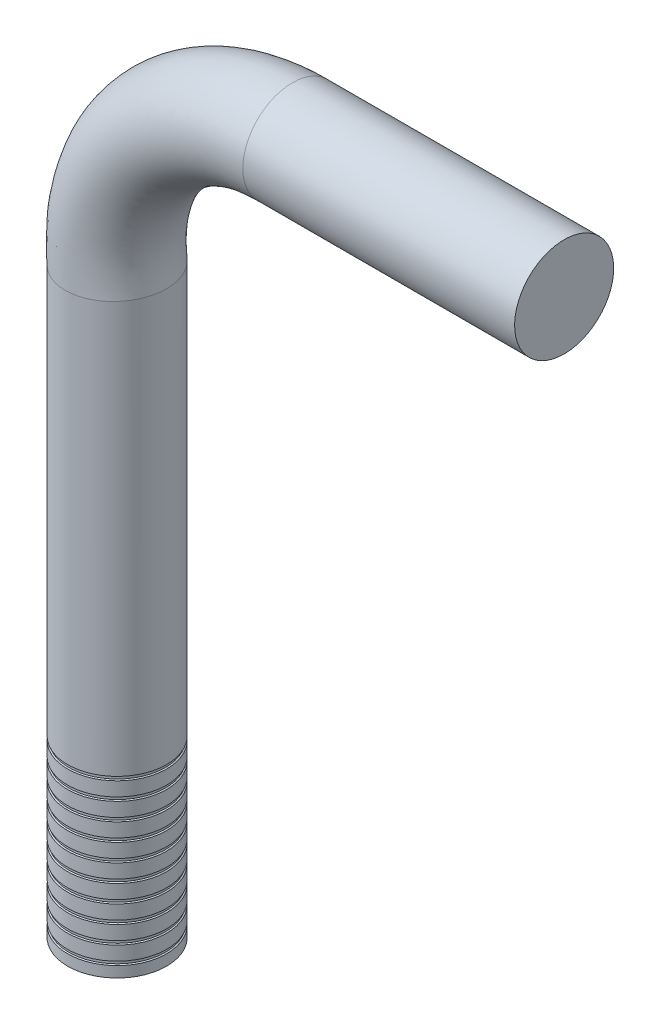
ISO-10303-21;
HEADER;
FILE_DESCRIPTION(('STEP AP214'),'2;1');
FILE_NAME('part.step','',(''),(''),'','','');
FILE_SCHEMA(('AUTOMOTIVE_DESIGN { 1 0 10303 214 1 1 1 1 }'));
ENDSEC;
DATA;
#1=APPLICATION_CONTEXT('core data for automotive mechanical design processes');
#2=APPLICATION_PROTOCOL_DEFINITION('international standard','automotive_design',2000,#1);
#3=PRODUCT_CONTEXT('',#1,'mechanical');
#4=PRODUCT('Part','Part','',(#3));
#5=PRODUCT_RELATED_PRODUCT_CATEGORY('part','',(#4));
#6=PRODUCT_DEFINITION_FORMATION('','',#4);
#7=PRODUCT_DEFINITION_CONTEXT('part definition',#1,'design');
#8=PRODUCT_DEFINITION('design','',#6,#7);
#9=PRODUCT_DEFINITION_SHAPE('','',#8);
#10=(LENGTH_UNIT() NAMED_UNIT(*) SI_UNIT(.MILLI.,.METRE.));
#11=(NAMED_UNIT(*) PLANE_ANGLE_UNIT() SI_UNIT($,.RADIAN.));
#12=(NAMED_UNIT(*) SI_UNIT($,.STERADIAN.) SOLID_ANGLE_UNIT());
#13=UNCERTAINTY_MEASURE_WITH_UNIT(LENGTH_MEASURE(1.E-05),#10,'distance_accuracy_value','');
#14=(GEOMETRIC_REPRESENTATION_CONTEXT(3) GLOBAL_UNCERTAINTY_ASSIGNED_CONTEXT((#13)) GLOBAL_UNIT_ASSIGNED_CONTEXT((#10,
#11,#12)) REPRESENTATION_CONTEXT('',''));
#15=CARTESIAN_POINT('',(0.,0.,0.));
#16=DIRECTION('',(0.,0.,1.));
#17=DIRECTION('',(1.,0.,0.));
#18=AXIS2_PLACEMENT_3D('',#15,#16,#17);
#19=CARTESIAN_POINT('',(0.,285.15432893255,0.));
#20=DIRECTION('',(0.,-1.,0.));
#21=DIRECTION('',(0.,0.,-1.));
#22=AXIS2_PLACEMENT_3D('',#19,#20,#21);
#23=CYLINDRICAL_SURFACE('',#22,19.5);
#24=CARTESIAN_POINT('',(0.,67.25,0.));
#25=DIRECTION('',(0.,-1.,0.));
#26=DIRECTION('',(0.,0.,-1.));
#27=AXIS2_PLACEMENT_3D('',#24,#25,#26);
#28=CIRCLE('',#27,19.5);
#29=CARTESIAN_POINT('',(0.,67.25,-19.5));
#30=VERTEX_POINT('',#29);
#31=EDGE_CURVE('E145',#30,#30,#28,.T.);
#32=ORIENTED_EDGE('',*,*,#31,.T.);
#33=EDGE_LOOP('',(#32));
#34=FACE_BOUND('',#33,.T.);
#35=CARTESIAN_POINT('',(0.,61.75,0.));
#36=DIRECTION('',(0.,-1.,0.));
#37=DIRECTION('',(0.,0.,-1.));
#38=AXIS2_PLACEMENT_3D('',#35,#36,#37);
#39=CIRCLE('',#38,19.5);
#40=CARTESIAN_POINT('',(0.,61.75,-19.5));
#41=VERTEX_POINT('',#40);
#42=EDGE_CURVE('E136',#41,#41,#39,.T.);
#43=ORIENTED_EDGE('',*,*,#42,.F.);
#44=EDGE_LOOP('',(#43));
#45=FACE_BOUND('',#44,.T.);
#46=ADVANCED_FACE('F14',(#34,#45),#23,.T.);
#47=CARTESIAN_POINT('',(0.,60.25,0.));
#48=DIRECTION('',(0.,-1.,0.));
#49=DIRECTION('',(0.,0.,-1.));
#50=AXIS2_PLACEMENT_3D('',#47,#48,#49);
#51=CIRCLE('',#50,19.5);
#52=CARTESIAN_POINT('',(0.,60.25,-19.5));
#53=VERTEX_POINT('',#52);
#54=EDGE_CURVE('E133',#53,#53,#51,.T.);
#55=ORIENTED_EDGE('',*,*,#54,.T.);
#56=EDGE_LOOP('',(#55));
#57=FACE_BOUND('',#56,.T.);
#58=CARTESIAN_POINT('',(0.,54.75,0.));
#59=DIRECTION('',(0.,-1.,0.));
#60=DIRECTION('',(0.,0.,-1.));
#61=AXIS2_PLACEMENT_3D('',#58,#59,#60);
#62=CIRCLE('',#61,19.5);
#63=CARTESIAN_POINT('',(0.,54.75,-19.5));
#64=VERTEX_POINT('',#63);
#65=EDGE_CURVE('E124',#64,#64,#62,.T.);
#66=ORIENTED_EDGE('',*,*,#65,.F.);
#67=EDGE_LOOP('',(#66));
#68=FACE_BOUND('',#67,.T.);
#69=ADVANCED_FACE('F178',(#57,#68),#23,.T.);
#70=CARTESIAN_POINT('',(0.,53.25,0.));
#71=DIRECTION('',(0.,-1.,0.));
#72=DIRECTION('',(0.,0.,-1.));
#73=AXIS2_PLACEMENT_3D('',#70,#71,#72);
#74=CIRCLE('',#73,19.5);
#75=CARTESIAN_POINT('',(0.,53.25,-19.5));
#76=VERTEX_POINT('',#75);
#77=EDGE_CURVE('E121',#76,#76,#74,.T.);
#78=ORIENTED_EDGE('',*,*,#77,.T.);
#79=EDGE_LOOP('',(#78));
#80=FACE_BOUND('',#79,.T.);
#81=CARTESIAN_POINT('',(0.,47.75,0.));
#82=DIRECTION('',(0.,-1.,0.));
#83=DIRECTION('',(0.,0.,-1.));
#84=AXIS2_PLACEMENT_3D('',#81,#82,#83);
#85=CIRCLE('',#84,19.5);
#86=CARTESIAN_POINT('',(0.,47.75,-19.5));
#87=VERTEX_POINT('',#86);
#88=EDGE_CURVE('E112',#87,#87,#85,.T.);
#89=ORIENTED_EDGE('',*,*,#88,.F.);
#90=EDGE_LOOP('',(#89));
#91=FACE_BOUND('',#90,.T.);
#92=ADVANCED_FACE('F548',(#80,#91),#23,.T.);
#93=CARTESIAN_POINT('',(0.,46.25,0.));
#94=DIRECTION('',(0.,-1.,0.));
#95=DIRECTION('',(0.,0.,-1.));
#96=AXIS2_PLACEMENT_3D('',#93,#94,#95);
#97=CIRCLE('',#96,19.5);
#98=CARTESIAN_POINT('',(0.,46.25,-19.5));
#99=VERTEX_POINT('',#98);
#100=EDGE_CURVE('E109',#99,#99,#97,.T.);
#101=ORIENTED_EDGE('',*,*,#100,.T.);
#102=EDGE_LOOP('',(#101));
#103=FACE_BOUND('',#102,.T.);
#104=CARTESIAN_POINT('',(0.,40.75,0.));
#105=DIRECTION('',(0.,-1.,0.));
#106=DIRECTION('',(0.,0.,-1.));
#107=AXIS2_PLACEMENT_3D('',#104,#105,#106);
#108=CIRCLE('',#107,19.5);
#109=CARTESIAN_POINT('',(0.,40.75,-19.5));
#110=VERTEX_POINT('',#109);
#111=EDGE_CURVE('E100',#110,#110,#108,.T.);
#112=ORIENTED_EDGE('',*,*,#111,.F.);
#113=EDGE_LOOP('',(#112));
#114=FACE_BOUND('',#113,.T.);
#115=ADVANCED_FACE('F539',(#103,#114),#23,.T.);
#116=CARTESIAN_POINT('',(0.,39.25,0.));
#117=DIRECTION('',(0.,-1.,0.));
#118=DIRECTION('',(0.,0.,-1.));
#119=AXIS2_PLACEMENT_3D('',#116,#117,#118);
#120=CIRCLE('',#119,19.5);
#121=CARTESIAN_POINT('',(0.,39.25,-19.5));
#122=VERTEX_POINT('',#121);
#123=EDGE_CURVE('E97',#122,#122,#120,.T.);
#124=ORIENTED_EDGE('',*,*,#123,.T.);
#125=EDGE_LOOP('',(#124));
#126=FACE_BOUND('',#125,.T.);
#127=CARTESIAN_POINT('',(0.,33.75,0.));
#128=DIRECTION('',(0.,-1.,0.));
#129=DIRECTION('',(0.,0.,-1.));
#130=AXIS2_PLACEMENT_3D('',#127,#128,#129);
#131=CIRCLE('',#130,19.5);
#132=CARTESIAN_POINT('',(0.,33.75,-19.5));
#133=VERTEX_POINT('',#132);
#134=EDGE_CURVE('E88',#133,#133,#131,.T.);
#135=ORIENTED_EDGE('',*,*,#134,.F.);
#136=EDGE_LOOP('',(#135));
#137=FACE_BOUND('',#136,.T.);
#138=ADVANCED_FACE('F530',(#126,#137),#23,.T.);
#139=CARTESIAN_POINT('',(0.,32.25,0.));
#140=DIRECTION('',(0.,-1.,0.));
#141=DIRECTION('',(0.,0.,-1.));
#142=AXIS2_PLACEMENT_3D('',#139,#140,#141);
#143=CIRCLE('',#142,19.5);
#144=CARTESIAN_POINT('',(0.,32.25,-19.5));
#145=VERTEX_POINT('',#144);
#146=EDGE_CURVE('E85',#145,#145,#143,.T.);
#147=ORIENTED_EDGE('',*,*,#146,.T.);
#148=EDGE_LOOP('',(#147));
#149=FACE_BOUND('',#148,.T.);
#150=CARTESIAN_POINT('',(0.,26.75,0.));
#151=DIRECTION('',(0.,-1.,0.));
#152=DIRECTION('',(0.,0.,-1.));
#153=AXIS2_PLACEMENT_3D('',#150,#151,#152);
#154=CIRCLE('',#153,19.5);
#155=CARTESIAN_POINT('',(0.,26.75,-19.5));
#156=VERTEX_POINT('',#155);
#157=EDGE_CURVE('E76',#156,#156,#154,.T.);
#158=ORIENTED_EDGE('',*,*,#157,.F.);
#159=EDGE_LOOP('',(#158));
#160=FACE_BOUND('',#159,.T.);
#161=ADVANCED_FACE('F521',(#149,#160),#23,.T.);
#162=CARTESIAN_POINT('',(0.,25.25,0.));
#163=DIRECTION('',(0.,-1.,0.));
#164=DIRECTION('',(0.,0.,-1.));
#165=AXIS2_PLACEMENT_3D('',#162,#163,#164);
#166=CIRCLE('',#165,19.5);
#167=CARTESIAN_POINT('',(0.,25.25,-19.5));
#168=VERTEX_POINT('',#167);
#169=EDGE_CURVE('E73',#168,#168,#166,.T.);
#170=ORIENTED_EDGE('',*,*,#169,.T.);
#171=EDGE_LOOP('',(#170));
#172=FACE_BOUND('',#171,.T.);
#173=CARTESIAN_POINT('',(0.,19.75,0.));
#174=DIRECTION('',(0.,-1.,0.));
#175=DIRECTION('',(0.,0.,-1.));
#176=AXIS2_PLACEMENT_3D('',#173,#174,#175);
#177=CIRCLE('',#176,19.5);
#178=CARTESIAN_POINT('',(0.,19.75,-19.5));
#179=VERTEX_POINT('',#178);
#180=EDGE_CURVE('E64',#179,#179,#177,.T.);
#181=ORIENTED_EDGE('',*,*,#180,.F.);
#182=EDGE_LOOP('',(#181));
#183=FACE_BOUND('',#182,.T.);
#184=ADVANCED_FACE('F208',(#172,#183),#23,.T.);
#185=CARTESIAN_POINT('',(0.,18.25,0.));
#186=DIRECTION('',(0.,-1.,0.));
#187=DIRECTION('',(0.,0.,-1.));
#188=AXIS2_PLACEMENT_3D('',#185,#186,#187);
#189=CIRCLE('',#188,19.5);
#190=CARTESIAN_POINT('',(0.,18.25,-19.5));
#191=VERTEX_POINT('',#190);
#192=EDGE_CURVE('E61',#191,#191,#189,.T.);
#193=ORIENTED_EDGE('',*,*,#192,.T.);
#194=EDGE_LOOP('',(#193));
#195=FACE_BOUND('',#194,.T.);
#196=CARTESIAN_POINT('',(0.,12.75,0.));
#197=DIRECTION('',(0.,-1.,0.));
#198=DIRECTION('',(0.,0.,-1.));
#199=AXIS2_PLACEMENT_3D('',#196,#197,#198);
#200=CIRCLE('',#199,19.5);
#201=CARTESIAN_POINT('',(0.,12.75,-19.5));
#202=VERTEX_POINT('',#201);
#203=EDGE_CURVE('E52',#202,#202,#200,.T.);
#204=ORIENTED_EDGE('',*,*,#203,.F.);
#205=EDGE_LOOP('',(#204));
#206=FACE_BOUND('',#205,.T.);
#207=ADVANCED_FACE('F198',(#195,#206),#23,.T.);
#208=CARTESIAN_POINT('',(0.,11.25,0.));
#209=DIRECTION('',(0.,-1.,0.));
#210=DIRECTION('',(0.,0.,-1.));
#211=AXIS2_PLACEMENT_3D('',#208,#209,#210);
#212=CIRCLE('',#211,19.5);
#213=CARTESIAN_POINT('',(0.,11.25,-19.5));
#214=VERTEX_POINT('',#213);
#215=EDGE_CURVE('E49',#214,#214,#212,.T.);
#216=ORIENTED_EDGE('',*,*,#215,.T.);
#217=EDGE_LOOP('',(#216));
#218=FACE_BOUND('',#217,.T.);
#219=CARTESIAN_POINT('',(0.,5.75,0.));
#220=DIRECTION('',(0.,-1.,0.));
#221=DIRECTION('',(0.,0.,-1.));
#222=AXIS2_PLACEMENT_3D('',#219,#220,#221);
#223=CIRCLE('',#222,19.5);
#224=CARTESIAN_POINT('',(0.,5.75,-19.5));
#225=VERTEX_POINT('',#224);
#226=EDGE_CURVE('E40',#225,#225,#223,.T.);
#227=ORIENTED_EDGE('',*,*,#226,.F.);
#228=EDGE_LOOP('',(#227));
#229=FACE_BOUND('',#228,.T.);
#230=ADVANCED_FACE('F184',(#218,#229),#23,.T.);
#231=CARTESIAN_POINT('',(0.,0.,0.));
#232=DIRECTION('',(0.,-1.,0.));
#233=DIRECTION('',(0.,0.,-1.));
#234=AXIS2_PLACEMENT_3D('',#231,#232,#233);
#235=CYLINDRICAL_SURFACE('',#234,19.);
#236=CARTESIAN_POINT('',(0.,4.5,0.));
#237=DIRECTION('',(0.,-1.,0.));
#238=DIRECTION('',(0.,0.,-1.));
#239=AXIS2_PLACEMENT_3D('',#236,#237,#238);
#240=CIRCLE('',#239,19.);
#241=CARTESIAN_POINT('',(0.,4.5,-19.));
#242=VERTEX_POINT('',#241);
#243=EDGE_CURVE('E34',#242,#242,#240,.T.);
#244=ORIENTED_EDGE('',*,*,#243,.F.);
#245=EDGE_LOOP('',(#244));
#246=FACE_BOUND('',#245,.T.);
#247=CARTESIAN_POINT('',(0.,5.5,0.));
#248=DIRECTION('',(0.,-1.,0.));
#249=DIRECTION('',(0.,0.,-1.));
#250=AXIS2_PLACEMENT_3D('',#247,#248,#249);
#251=CIRCLE('',#250,19.);
#252=CARTESIAN_POINT('',(0.,5.5,-19.));
#253=VERTEX_POINT('',#252);
#254=EDGE_CURVE('E43',#253,#253,#251,.T.);
#255=ORIENTED_EDGE('',*,*,#254,.T.);
#256=EDGE_LOOP('',(#255));
#257=FACE_BOUND('',#256,.T.);
#258=ADVANCED_FACE('F197',(#246,#257),#235,.T.);
#259=CARTESIAN_POINT('',(0.,4.5,0.));
#260=DIRECTION('',(0.,-1.,0.));
#261=DIRECTION('',(0.,0.,-1.));
#262=AXIS2_PLACEMENT_3D('',#259,#260,#261);
#263=CONICAL_SURFACE('',#262,19.,1.10714871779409);
#264=CARTESIAN_POINT('',(0.,4.25,0.));
#265=DIRECTION('',(0.,-1.,0.));
#266=DIRECTION('',(0.,0.,-1.));
#267=AXIS2_PLACEMENT_3D('',#264,#265,#266);
#268=CIRCLE('',#267,19.5);
#269=CARTESIAN_POINT('',(0.,4.25,-19.5));
#270=VERTEX_POINT('',#269);
#271=EDGE_CURVE('E37',#270,#270,#268,.T.);
#272=ORIENTED_EDGE('',*,*,#271,.F.);
#273=EDGE_LOOP('',(#272));
#274=FACE_BOUND('',#273,.T.);
#275=ORIENTED_EDGE('',*,*,#243,.T.);
#276=EDGE_LOOP('',(#275));
#277=FACE_BOUND('',#276,.T.);
#278=ADVANCED_FACE('F205',(#274,#277),#263,.T.);
#279=CARTESIAN_POINT('',(0.,5.75,0.));
#280=DIRECTION('',(0.,1.,0.));
#281=DIRECTION('',(0.,0.,1.));
#282=AXIS2_PLACEMENT_3D('',#279,#280,#281);
#283=CONICAL_SURFACE('',#282,19.5,1.10714871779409);
#284=ORIENTED_EDGE('',*,*,#254,.F.);
#285=EDGE_LOOP('',(#284));
#286=FACE_BOUND('',#285,.T.);
#287=ORIENTED_EDGE('',*,*,#226,.T.);
#288=EDGE_LOOP('',(#287));
#289=FACE_BOUND('',#288,.T.);
#290=ADVANCED_FACE('F193',(#286,#289),#283,.T.);
#291=CARTESIAN_POINT('',(0.,0.,0.));
#292=DIRECTION('',(0.,1.,0.));
#293=DIRECTION('',(0.,0.,1.));
#294=AXIS2_PLACEMENT_3D('',#291,#292,#293);
#295=PLANE('',#294);
#296=CARTESIAN_POINT('',(0.,0.,0.));
#297=DIRECTION('',(0.,1.,0.));
#298=DIRECTION('',(0.,0.,1.));
#299=AXIS2_PLACEMENT_3D('',#296,#297,#298);
#300=CIRCLE('',#299,19.5);
#301=CARTESIAN_POINT('',(0.,0.,19.5));
#302=VERTEX_POINT('',#301);
#303=EDGE_CURVE('E25',#302,#302,#300,.T.);
#304=ORIENTED_EDGE('',*,*,#303,.F.);
#305=EDGE_LOOP('',(#304));
#306=FACE_BOUND('',#305,.T.);
#307=ADVANCED_FACE('F182',(#306),#295,.F.);
#308=ORIENTED_EDGE('',*,*,#271,.T.);
#309=EDGE_LOOP('',(#308));
#310=FACE_BOUND('',#309,.T.);
#311=ORIENTED_EDGE('',*,*,#303,.T.);
#312=EDGE_LOOP('',(#311));
#313=FACE_BOUND('',#312,.T.);
#314=ADVANCED_FACE('F169',(#310,#313),#23,.T.);
#315=CARTESIAN_POINT('',(0.,7.,0.));
#316=DIRECTION('',(0.,-1.,0.));
#317=DIRECTION('',(0.,0.,-1.));
#318=AXIS2_PLACEMENT_3D('',#315,#316,#317);
#319=CYLINDRICAL_SURFACE('',#318,19.);
#320=CARTESIAN_POINT('',(0.,11.5,0.));
#321=DIRECTION('',(0.,-1.,0.));
#322=DIRECTION('',(0.,0.,-1.));
#323=AXIS2_PLACEMENT_3D('',#320,#321,#322);
#324=CIRCLE('',#323,19.);
#325=CARTESIAN_POINT('',(0.,11.5,-19.));
#326=VERTEX_POINT('',#325);
#327=EDGE_CURVE('E46',#326,#326,#324,.T.);
#328=ORIENTED_EDGE('',*,*,#327,.F.);
#329=EDGE_LOOP('',(#328));
#330=FACE_BOUND('',#329,.T.);
#331=CARTESIAN_POINT('',(0.,12.5,0.));
#332=DIRECTION('',(0.,-1.,0.));
#333=DIRECTION('',(0.,0.,-1.));
#334=AXIS2_PLACEMENT_3D('',#331,#332,#333);
#335=CIRCLE('',#334,19.);
#336=CARTESIAN_POINT('',(0.,12.5,-19.));
#337=VERTEX_POINT('',#336);
#338=EDGE_CURVE('E55',#337,#337,#335,.T.);
#339=ORIENTED_EDGE('',*,*,#338,.T.);
#340=EDGE_LOOP('',(#339));
#341=FACE_BOUND('',#340,.T.);
#342=ADVANCED_FACE('F181',(#330,#341),#319,.T.);
#343=CARTESIAN_POINT('',(0.,11.5,0.));
#344=DIRECTION('',(0.,-1.,0.));
#345=DIRECTION('',(0.,0.,-1.));
#346=AXIS2_PLACEMENT_3D('',#343,#344,#345);
#347=CONICAL_SURFACE('',#346,19.,1.10714871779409);
#348=ORIENTED_EDGE('',*,*,#215,.F.);
#349=EDGE_LOOP('',(#348));
#350=FACE_BOUND('',#349,.T.);
#351=ORIENTED_EDGE('',*,*,#327,.T.);
#352=EDGE_LOOP('',(#351));
#353=FACE_BOUND('',#352,.T.);
#354=ADVANCED_FACE('F190',(#350,#353),#347,.T.);
#355=CARTESIAN_POINT('',(0.,12.75,0.));
#356=DIRECTION('',(0.,1.,0.));
#357=DIRECTION('',(0.,0.,1.));
#358=AXIS2_PLACEMENT_3D('',#355,#356,#357);
#359=CONICAL_SURFACE('',#358,19.5,1.10714871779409);
#360=ORIENTED_EDGE('',*,*,#338,.F.);
#361=EDGE_LOOP('',(#360));
#362=FACE_BOUND('',#361,.T.);
#363=ORIENTED_EDGE('',*,*,#203,.T.);
#364=EDGE_LOOP('',(#363));
#365=FACE_BOUND('',#364,.T.);
#366=ADVANCED_FACE('F502',(#362,#365),#359,.T.);
#367=CARTESIAN_POINT('',(0.,14.,0.));
#368=DIRECTION('',(0.,-1.,0.));
#369=DIRECTION('',(0.,0.,-1.));
#370=AXIS2_PLACEMENT_3D('',#367,#368,#369);
#371=CYLINDRICAL_SURFACE('',#370,19.);
#372=CARTESIAN_POINT('',(0.,18.5,0.));
#373=DIRECTION('',(0.,-1.,0.));
#374=DIRECTION('',(0.,0.,-1.));
#375=AXIS2_PLACEMENT_3D('',#372,#373,#374);
#376=CIRCLE('',#375,19.);
#377=CARTESIAN_POINT('',(0.,18.5,-19.));
#378=VERTEX_POINT('',#377);
#379=EDGE_CURVE('E58',#378,#378,#376,.T.);
#380=ORIENTED_EDGE('',*,*,#379,.F.);
#381=EDGE_LOOP('',(#380));
#382=FACE_BOUND('',#381,.T.);
#383=CARTESIAN_POINT('',(0.,19.5,0.));
#384=DIRECTION('',(0.,-1.,0.));
#385=DIRECTION('',(0.,0.,-1.));
#386=AXIS2_PLACEMENT_3D('',#383,#384,#385);
#387=CIRCLE('',#386,19.);
#388=CARTESIAN_POINT('',(0.,19.5,-19.));
#389=VERTEX_POINT('',#388);
#390=EDGE_CURVE('E67',#389,#389,#387,.T.);
#391=ORIENTED_EDGE('',*,*,#390,.T.);
#392=EDGE_LOOP('',(#391));
#393=FACE_BOUND('',#392,.T.);
#394=ADVANCED_FACE('F494',(#382,#393),#371,.T.);
#395=CARTESIAN_POINT('',(0.,18.5,0.));
#396=DIRECTION('',(0.,-1.,0.));
#397=DIRECTION('',(0.,0.,-1.));
#398=AXIS2_PLACEMENT_3D('',#395,#396,#397);
#399=CONICAL_SURFACE('',#398,19.,1.10714871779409);
#400=ORIENTED_EDGE('',*,*,#192,.F.);
#401=EDGE_LOOP('',(#400));
#402=FACE_BOUND('',#401,.T.);
#403=ORIENTED_EDGE('',*,*,#379,.T.);
#404=EDGE_LOOP('',(#403));
#405=FACE_BOUND('',#404,.T.);
#406=ADVANCED_FACE('F486',(#402,#405),#399,.T.);
#407=CARTESIAN_POINT('',(0.,19.75,0.));
#408=DIRECTION('',(0.,1.,0.));
#409=DIRECTION('',(0.,0.,1.));
#410=AXIS2_PLACEMENT_3D('',#407,#408,#409);
#411=CONICAL_SURFACE('',#410,19.5,1.10714871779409);
#412=ORIENTED_EDGE('',*,*,#390,.F.);
#413=EDGE_LOOP('',(#412));
#414=FACE_BOUND('',#413,.T.);
#415=ORIENTED_EDGE('',*,*,#180,.T.);
#416=EDGE_LOOP('',(#415));
#417=FACE_BOUND('',#416,.T.);
#418=ADVANCED_FACE('F478',(#414,#417),#411,.T.);
#419=CARTESIAN_POINT('',(0.,21.,0.));
#420=DIRECTION('',(0.,-1.,0.));
#421=DIRECTION('',(0.,0.,-1.));
#422=AXIS2_PLACEMENT_3D('',#419,#420,#421);
#423=CYLINDRICAL_SURFACE('',#422,19.);
#424=CARTESIAN_POINT('',(0.,25.5,0.));
#425=DIRECTION('',(0.,-1.,0.));
#426=DIRECTION('',(0.,0.,-1.));
#427=AXIS2_PLACEMENT_3D('',#424,#425,#426);
#428=CIRCLE('',#427,19.);
#429=CARTESIAN_POINT('',(0.,25.5,-19.));
#430=VERTEX_POINT('',#429);
#431=EDGE_CURVE('E70',#430,#430,#428,.T.);
#432=ORIENTED_EDGE('',*,*,#431,.F.);
#433=EDGE_LOOP('',(#432));
#434=FACE_BOUND('',#433,.T.);
#435=CARTESIAN_POINT('',(0.,26.5,0.));
#436=DIRECTION('',(0.,-1.,0.));
#437=DIRECTION('',(0.,0.,-1.));
#438=AXIS2_PLACEMENT_3D('',#435,#436,#437);
#439=CIRCLE('',#438,19.);
#440=CARTESIAN_POINT('',(0.,26.5,-19.));
#441=VERTEX_POINT('',#440);
#442=EDGE_CURVE('E79',#441,#441,#439,.T.);
#443=ORIENTED_EDGE('',*,*,#442,.T.);
#444=EDGE_LOOP('',(#443));
#445=FACE_BOUND('',#444,.T.);
#446=ADVANCED_FACE('F470',(#434,#445),#423,.T.);
#447=CARTESIAN_POINT('',(0.,25.5,0.));
#448=DIRECTION('',(0.,-1.,0.));
#449=DIRECTION('',(0.,0.,-1.));
#450=AXIS2_PLACEMENT_3D('',#447,#448,#449);
#451=CONICAL_SURFACE('',#450,19.,1.10714871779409);
#452=ORIENTED_EDGE('',*,*,#169,.F.);
#453=EDGE_LOOP('',(#452));
#454=FACE_BOUND('',#453,.T.);
#455=ORIENTED_EDGE('',*,*,#431,.T.);
#456=EDGE_LOOP('',(#455));
#457=FACE_BOUND('',#456,.T.);
#458=ADVANCED_FACE('F462',(#454,#457),#451,.T.);
#459=CARTESIAN_POINT('',(0.,26.75,0.));
#460=DIRECTION('',(0.,1.,0.));
#461=DIRECTION('',(0.,0.,1.));
#462=AXIS2_PLACEMENT_3D('',#459,#460,#461);
#463=CONICAL_SURFACE('',#462,19.5,1.10714871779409);
#464=ORIENTED_EDGE('',*,*,#442,.F.);
#465=EDGE_LOOP('',(#464));
#466=FACE_BOUND('',#465,.T.);
#467=ORIENTED_EDGE('',*,*,#157,.T.);
#468=EDGE_LOOP('',(#467));
#469=FACE_BOUND('',#468,.T.);
#470=ADVANCED_FACE('F454',(#466,#469),#463,.T.);
#471=CARTESIAN_POINT('',(0.,28.,0.));
#472=DIRECTION('',(0.,-1.,0.));
#473=DIRECTION('',(0.,0.,-1.));
#474=AXIS2_PLACEMENT_3D('',#471,#472,#473);
#475=CYLINDRICAL_SURFACE('',#474,19.);
#476=CARTESIAN_POINT('',(0.,32.5,0.));
#477=DIRECTION('',(0.,-1.,0.));
#478=DIRECTION('',(0.,0.,-1.));
#479=AXIS2_PLACEMENT_3D('',#476,#477,#478);
#480=CIRCLE('',#479,19.);
#481=CARTESIAN_POINT('',(0.,32.5,-19.));
#482=VERTEX_POINT('',#481);
#483=EDGE_CURVE('E82',#482,#482,#480,.T.);
#484=ORIENTED_EDGE('',*,*,#483,.F.);
#485=EDGE_LOOP('',(#484));
#486=FACE_BOUND('',#485,.T.);
#487=CARTESIAN_POINT('',(0.,33.5,0.));
#488=DIRECTION('',(0.,-1.,0.));
#489=DIRECTION('',(0.,0.,-1.));
#490=AXIS2_PLACEMENT_3D('',#487,#488,#489);
#491=CIRCLE('',#490,19.);
#492=CARTESIAN_POINT('',(0.,33.5,-19.));
#493=VERTEX_POINT('',#492);
#494=EDGE_CURVE('E91',#493,#493,#491,.T.);
#495=ORIENTED_EDGE('',*,*,#494,.T.);
#496=EDGE_LOOP('',(#495));
#497=FACE_BOUND('',#496,.T.);
#498=ADVANCED_FACE('F446',(#486,#497),#475,.T.);
#499=CARTESIAN_POINT('',(0.,32.5,0.));
#500=DIRECTION('',(0.,-1.,0.));
#501=DIRECTION('',(0.,0.,-1.));
#502=AXIS2_PLACEMENT_3D('',#499,#500,#501);
#503=CONICAL_SURFACE('',#502,19.,1.10714871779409);
#504=ORIENTED_EDGE('',*,*,#146,.F.);
#505=EDGE_LOOP('',(#504));
#506=FACE_BOUND('',#505,.T.);
#507=ORIENTED_EDGE('',*,*,#483,.T.);
#508=EDGE_LOOP('',(#507));
#509=FACE_BOUND('',#508,.T.);
#510=ADVANCED_FACE('F438',(#506,#509),#503,.T.);
#511=CARTESIAN_POINT('',(0.,33.75,0.));
#512=DIRECTION('',(0.,1.,0.));
#513=DIRECTION('',(0.,0.,1.));
#514=AXIS2_PLACEMENT_3D('',#511,#512,#513);
#515=CONICAL_SURFACE('',#514,19.5,1.10714871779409);
#516=ORIENTED_EDGE('',*,*,#494,.F.);
#517=EDGE_LOOP('',(#516));
#518=FACE_BOUND('',#517,.T.);
#519=ORIENTED_EDGE('',*,*,#134,.T.);
#520=EDGE_LOOP('',(#519));
#521=FACE_BOUND('',#520,.T.);
#522=ADVANCED_FACE('F430',(#518,#521),#515,.T.);
#523=CARTESIAN_POINT('',(0.,35.,0.));
#524=DIRECTION('',(0.,-1.,0.));
#525=DIRECTION('',(0.,0.,-1.));
#526=AXIS2_PLACEMENT_3D('',#523,#524,#525);
#527=CYLINDRICAL_SURFACE('',#526,19.);
#528=CARTESIAN_POINT('',(0.,39.5,0.));
#529=DIRECTION('',(0.,-1.,0.));
#530=DIRECTION('',(0.,0.,-1.));
#531=AXIS2_PLACEMENT_3D('',#528,#529,#530);
#532=CIRCLE('',#531,19.);
#533=CARTESIAN_POINT('',(0.,39.5,-19.));
#534=VERTEX_POINT('',#533);
#535=EDGE_CURVE('E94',#534,#534,#532,.T.);
#536=ORIENTED_EDGE('',*,*,#535,.F.);
#537=EDGE_LOOP('',(#536));
#538=FACE_BOUND('',#537,.T.);
#539=CARTESIAN_POINT('',(0.,40.5,0.));
#540=DIRECTION('',(0.,-1.,0.));
#541=DIRECTION('',(0.,0.,-1.));
#542=AXIS2_PLACEMENT_3D('',#539,#540,#541);
#543=CIRCLE('',#542,19.);
#544=CARTESIAN_POINT('',(0.,40.5,-19.));
#545=VERTEX_POINT('',#544);
#546=EDGE_CURVE('E103',#545,#545,#543,.T.);
#547=ORIENTED_EDGE('',*,*,#546,.T.);
#548=EDGE_LOOP('',(#547));
#549=FACE_BOUND('',#548,.T.);
#550=ADVANCED_FACE('F422',(#538,#549),#527,.T.);
#551=CARTESIAN_POINT('',(0.,39.5,0.));
#552=DIRECTION('',(0.,-1.,0.));
#553=DIRECTION('',(0.,0.,-1.));
#554=AXIS2_PLACEMENT_3D('',#551,#552,#553);
#555=CONICAL_SURFACE('',#554,19.,1.10714871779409);
#556=ORIENTED_EDGE('',*,*,#123,.F.);
#557=EDGE_LOOP('',(#556));
#558=FACE_BOUND('',#557,.T.);
#559=ORIENTED_EDGE('',*,*,#535,.T.);
#560=EDGE_LOOP('',(#559));
#561=FACE_BOUND('',#560,.T.);
#562=ADVANCED_FACE('F414',(#558,#561),#555,.T.);
#563=CARTESIAN_POINT('',(0.,40.75,0.));
#564=DIRECTION('',(0.,1.,0.));
#565=DIRECTION('',(0.,0.,1.));
#566=AXIS2_PLACEMENT_3D('',#563,#564,#565);
#567=CONICAL_SURFACE('',#566,19.5,1.10714871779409);
#568=ORIENTED_EDGE('',*,*,#546,.F.);
#569=EDGE_LOOP('',(#568));
#570=FACE_BOUND('',#569,.T.);
#571=ORIENTED_EDGE('',*,*,#111,.T.);
#572=EDGE_LOOP('',(#571));
#573=FACE_BOUND('',#572,.T.);
#574=ADVANCED_FACE('F406',(#570,#573),#567,.T.);
#575=CARTESIAN_POINT('',(0.,42.,0.));
#576=DIRECTION('',(0.,-1.,0.));
#577=DIRECTION('',(0.,0.,-1.));
#578=AXIS2_PLACEMENT_3D('',#575,#576,#577);
#579=CYLINDRICAL_SURFACE('',#578,19.);
#580=CARTESIAN_POINT('',(0.,46.5,0.));
#581=DIRECTION('',(0.,-1.,0.));
#582=DIRECTION('',(0.,0.,-1.));
#583=AXIS2_PLACEMENT_3D('',#580,#581,#582);
#584=CIRCLE('',#583,19.);
#585=CARTESIAN_POINT('',(0.,46.5,-19.));
#586=VERTEX_POINT('',#585);
#587=EDGE_CURVE('E106',#586,#586,#584,.T.);
#588=ORIENTED_EDGE('',*,*,#587,.F.);
#589=EDGE_LOOP('',(#588));
#590=FACE_BOUND('',#589,.T.);
#591=CARTESIAN_POINT('',(0.,47.5,0.));
#592=DIRECTION('',(0.,-1.,0.));
#593=DIRECTION('',(0.,0.,-1.));
#594=AXIS2_PLACEMENT_3D('',#591,#592,#593);
#595=CIRCLE('',#594,19.);
#596=CARTESIAN_POINT('',(0.,47.5,-19.));
#597=VERTEX_POINT('',#596);
#598=EDGE_CURVE('E115',#597,#597,#595,.T.);
#599=ORIENTED_EDGE('',*,*,#598,.T.);
#600=EDGE_LOOP('',(#599));
#601=FACE_BOUND('',#600,.T.);
#602=ADVANCED_FACE('F398',(#590,#601),#579,.T.);
#603=CARTESIAN_POINT('',(0.,46.5,0.));
#604=DIRECTION('',(0.,-1.,0.));
#605=DIRECTION('',(0.,0.,-1.));
#606=AXIS2_PLACEMENT_3D('',#603,#604,#605);
#607=CONICAL_SURFACE('',#606,19.,1.10714871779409);
#608=ORIENTED_EDGE('',*,*,#100,.F.);
#609=EDGE_LOOP('',(#608));
#610=FACE_BOUND('',#609,.T.);
#611=ORIENTED_EDGE('',*,*,#587,.T.);
#612=EDGE_LOOP('',(#611));
#613=FACE_BOUND('',#612,.T.);
#614=ADVANCED_FACE('F390',(#610,#613),#607,.T.);
#615=CARTESIAN_POINT('',(0.,47.75,0.));
#616=DIRECTION('',(0.,1.,0.));
#617=DIRECTION('',(0.,0.,1.));
#618=AXIS2_PLACEMENT_3D('',#615,#616,#617);
#619=CONICAL_SURFACE('',#618,19.5,1.10714871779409);
#620=ORIENTED_EDGE('',*,*,#598,.F.);
#621=EDGE_LOOP('',(#620));
#622=FACE_BOUND('',#621,.T.);
#623=ORIENTED_EDGE('',*,*,#88,.T.);
#624=EDGE_LOOP('',(#623));
#625=FACE_BOUND('',#624,.T.);
#626=ADVANCED_FACE('F382',(#622,#625),#619,.T.);
#627=CARTESIAN_POINT('',(0.,49.,0.));
#628=DIRECTION('',(0.,-1.,0.));
#629=DIRECTION('',(0.,0.,-1.));
#630=AXIS2_PLACEMENT_3D('',#627,#628,#629);
#631=CYLINDRICAL_SURFACE('',#630,19.);
#632=CARTESIAN_POINT('',(0.,53.5,0.));
#633=DIRECTION('',(0.,-1.,0.));
#634=DIRECTION('',(0.,0.,-1.));
#635=AXIS2_PLACEMENT_3D('',#632,#633,#634);
#636=CIRCLE('',#635,19.);
#637=CARTESIAN_POINT('',(0.,53.5,-19.));
#638=VERTEX_POINT('',#637);
#639=EDGE_CURVE('E118',#638,#638,#636,.T.);
#640=ORIENTED_EDGE('',*,*,#639,.F.);
#641=EDGE_LOOP('',(#640));
#642=FACE_BOUND('',#641,.T.);
#643=CARTESIAN_POINT('',(0.,54.5,0.));
#644=DIRECTION('',(0.,-1.,0.));
#645=DIRECTION('',(0.,0.,-1.));
#646=AXIS2_PLACEMENT_3D('',#643,#644,#645);
#647=CIRCLE('',#646,19.);
#648=CARTESIAN_POINT('',(0.,54.5,-19.));
#649=VERTEX_POINT('',#648);
#650=EDGE_CURVE('E127',#649,#649,#647,.T.);
#651=ORIENTED_EDGE('',*,*,#650,.T.);
#652=EDGE_LOOP('',(#651));
#653=FACE_BOUND('',#652,.T.);
#654=ADVANCED_FACE('F374',(#642,#653),#631,.T.);
#655=CARTESIAN_POINT('',(0.,53.5,0.));
#656=DIRECTION('',(0.,-1.,0.));
#657=DIRECTION('',(0.,0.,-1.));
#658=AXIS2_PLACEMENT_3D('',#655,#656,#657);
#659=CONICAL_SURFACE('',#658,19.,1.10714871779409);
#660=ORIENTED_EDGE('',*,*,#77,.F.);
#661=EDGE_LOOP('',(#660));
#662=FACE_BOUND('',#661,.T.);
#663=ORIENTED_EDGE('',*,*,#639,.T.);
#664=EDGE_LOOP('',(#663));
#665=FACE_BOUND('',#664,.T.);
#666=ADVANCED_FACE('F366',(#662,#665),#659,.T.);
#667=CARTESIAN_POINT('',(0.,54.75,0.));
#668=DIRECTION('',(0.,1.,0.));
#669=DIRECTION('',(0.,0.,1.));
#670=AXIS2_PLACEMENT_3D('',#667,#668,#669);
#671=CONICAL_SURFACE('',#670,19.5,1.10714871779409);
#672=ORIENTED_EDGE('',*,*,#650,.F.);
#673=EDGE_LOOP('',(#672));
#674=FACE_BOUND('',#673,.T.);
#675=ORIENTED_EDGE('',*,*,#65,.T.);
#676=EDGE_LOOP('',(#675));
#677=FACE_BOUND('',#676,.T.);
#678=ADVANCED_FACE('F358',(#674,#677),#671,.T.);
#679=CARTESIAN_POINT('',(0.,56.,0.));
#680=DIRECTION('',(0.,-1.,0.));
#681=DIRECTION('',(0.,0.,-1.));
#682=AXIS2_PLACEMENT_3D('',#679,#680,#681);
#683=CYLINDRICAL_SURFACE('',#682,19.);
#684=CARTESIAN_POINT('',(0.,60.5,0.));
#685=DIRECTION('',(0.,-1.,0.));
#686=DIRECTION('',(0.,0.,-1.));
#687=AXIS2_PLACEMENT_3D('',#684,#685,#686);
#688=CIRCLE('',#687,19.);
#689=CARTESIAN_POINT('',(0.,60.5,-19.));
#690=VERTEX_POINT('',#689);
#691=EDGE_CURVE('E130',#690,#690,#688,.T.);
#692=ORIENTED_EDGE('',*,*,#691,.F.);
#693=EDGE_LOOP('',(#692));
#694=FACE_BOUND('',#693,.T.);
#695=CARTESIAN_POINT('',(0.,61.5,0.));
#696=DIRECTION('',(0.,-1.,0.));
#697=DIRECTION('',(0.,0.,-1.));
#698=AXIS2_PLACEMENT_3D('',#695,#696,#697);
#699=CIRCLE('',#698,19.);
#700=CARTESIAN_POINT('',(0.,61.5,-19.));
#701=VERTEX_POINT('',#700);
#702=EDGE_CURVE('E139',#701,#701,#699,.T.);
#703=ORIENTED_EDGE('',*,*,#702,.T.);
#704=EDGE_LOOP('',(#703));
#705=FACE_BOUND('',#704,.T.);
#706=ADVANCED_FACE('F350',(#694,#705),#683,.T.);
#707=CARTESIAN_POINT('',(0.,60.5,0.));
#708=DIRECTION('',(0.,-1.,0.));
#709=DIRECTION('',(0.,0.,-1.));
#710=AXIS2_PLACEMENT_3D('',#707,#708,#709);
#711=CONICAL_SURFACE('',#710,19.,1.10714871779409);
#712=ORIENTED_EDGE('',*,*,#54,.F.);
#713=EDGE_LOOP('',(#712));
#714=FACE_BOUND('',#713,.T.);
#715=ORIENTED_EDGE('',*,*,#691,.T.);
#716=EDGE_LOOP('',(#715));
#717=FACE_BOUND('',#716,.T.);
#718=ADVANCED_FACE('F342',(#714,#717),#711,.T.);
#719=CARTESIAN_POINT('',(0.,61.75,0.));
#720=DIRECTION('',(0.,1.,0.));
#721=DIRECTION('',(0.,0.,1.));
#722=AXIS2_PLACEMENT_3D('',#719,#720,#721);
#723=CONICAL_SURFACE('',#722,19.5,1.10714871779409);
#724=ORIENTED_EDGE('',*,*,#702,.F.);
#725=EDGE_LOOP('',(#724));
#726=FACE_BOUND('',#725,.T.);
#727=ORIENTED_EDGE('',*,*,#42,.T.);
#728=EDGE_LOOP('',(#727));
#729=FACE_BOUND('',#728,.T.);
#730=ADVANCED_FACE('F334',(#726,#729),#723,.T.);
#731=CARTESIAN_POINT('',(0.,63.,0.));
#732=DIRECTION('',(0.,-1.,0.));
#733=DIRECTION('',(0.,0.,-1.));
#734=AXIS2_PLACEMENT_3D('',#731,#732,#733);
#735=CYLINDRICAL_SURFACE('',#734,19.);
#736=CARTESIAN_POINT('',(0.,67.5,0.));
#737=DIRECTION('',(0.,-1.,0.));
#738=DIRECTION('',(0.,0.,-1.));
#739=AXIS2_PLACEMENT_3D('',#736,#737,#738);
#740=CIRCLE('',#739,19.);
#741=CARTESIAN_POINT('',(0.,67.5,-19.));
#742=VERTEX_POINT('',#741);
#743=EDGE_CURVE('E142',#742,#742,#740,.T.);
#744=ORIENTED_EDGE('',*,*,#743,.F.);
#745=EDGE_LOOP('',(#744));
#746=FACE_BOUND('',#745,.T.);
#747=CARTESIAN_POINT('',(0.,68.5,0.));
#748=DIRECTION('',(0.,-1.,0.));
#749=DIRECTION('',(0.,0.,-1.));
#750=AXIS2_PLACEMENT_3D('',#747,#748,#749);
#751=CIRCLE('',#750,19.);
#752=CARTESIAN_POINT('',(0.,68.5,-19.));
#753=VERTEX_POINT('',#752);
#754=EDGE_CURVE('E151',#753,#753,#751,.T.);
#755=ORIENTED_EDGE('',*,*,#754,.T.);
#756=EDGE_LOOP('',(#755));
#757=FACE_BOUND('',#756,.T.);
#758=ADVANCED_FACE('F155',(#746,#757),#735,.T.);
#759=CARTESIAN_POINT('',(0.,67.5,0.));
#760=DIRECTION('',(0.,-1.,0.));
#761=DIRECTION('',(0.,0.,-1.));
#762=AXIS2_PLACEMENT_3D('',#759,#760,#761);
#763=CONICAL_SURFACE('',#762,19.,1.10714871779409);
#764=ORIENTED_EDGE('',*,*,#31,.F.);
#765=EDGE_LOOP('',(#764));
#766=FACE_BOUND('',#765,.T.);
#767=ORIENTED_EDGE('',*,*,#743,.T.);
#768=EDGE_LOOP('',(#767));
#769=FACE_BOUND('',#768,.T.);
#770=ADVANCED_FACE('F161',(#766,#769),#763,.T.);
#771=CARTESIAN_POINT('',(0.,68.75,0.));
#772=DIRECTION('',(0.,1.,0.));
#773=DIRECTION('',(0.,0.,1.));
#774=AXIS2_PLACEMENT_3D('',#771,#772,#773);
#775=CONICAL_SURFACE('',#774,19.5,1.10714871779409);
#776=ORIENTED_EDGE('',*,*,#754,.F.);
#777=EDGE_LOOP('',(#776));
#778=FACE_BOUND('',#777,.T.);
#779=CARTESIAN_POINT('',(0.,68.75,0.));
#780=DIRECTION('',(0.,-1.,0.));
#781=DIRECTION('',(0.,0.,-1.));
#782=AXIS2_PLACEMENT_3D('',#779,#780,#781);
#783=CIRCLE('',#782,19.5);
#784=CARTESIAN_POINT('',(0.,68.75,-19.5));
#785=VERTEX_POINT('',#784);
#786=EDGE_CURVE('E148',#785,#785,#783,.T.);
#787=ORIENTED_EDGE('',*,*,#786,.T.);
#788=EDGE_LOOP('',(#787));
#789=FACE_BOUND('',#788,.T.);
#790=ADVANCED_FACE('F157',(#778,#789),#775,.T.);
#791=CARTESIAN_POINT('',(176.,287.,0.));
#792=DIRECTION('',(-1.,0.,0.));
#793=DIRECTION('',(0.,-1.,0.));
#794=AXIS2_PLACEMENT_3D('',#791,#792,#793);
#795=PLANE('',#794);
#796=CARTESIAN_POINT('',(176.,306.5,0.));
#797=DIRECTION('',(-1.,0.,0.));
#798=DIRECTION('',(0.,-1.,0.));
#799=AXIS2_PLACEMENT_3D('',#796,#797,#798);
#800=CIRCLE('',#799,19.5);
#801=CARTESIAN_POINT('',(176.,287.,0.));
#802=VERTEX_POINT('',#801);
#803=EDGE_CURVE('E9',#802,#802,#800,.T.);
#804=ORIENTED_EDGE('',*,*,#803,.F.);
#805=EDGE_LOOP('',(#804));
#806=FACE_BOUND('',#805,.T.);
#807=ADVANCED_FACE('F160',(#806),#795,.F.);
#808=CARTESIAN_POINT('',(69.,306.5,0.));
#809=DIRECTION('',(1.,0.,0.));
#810=DIRECTION('',(0.,1.,0.));
#811=AXIS2_PLACEMENT_3D('',#808,#809,#810);
#812=CYLINDRICAL_SURFACE('',#811,19.5);
#813=CARTESIAN_POINT('',(69.,306.5,0.));
#814=DIRECTION('',(-1.,0.,0.));
#815=DIRECTION('',(0.,-1.,0.));
#816=AXIS2_PLACEMENT_3D('',#813,#814,#815);
#817=CIRCLE('',#816,19.5);
#818=CARTESIAN_POINT('',(68.9999999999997,287.,0.));
#819=VERTEX_POINT('',#818);
#820=EDGE_CURVE('E29',#819,#819,#817,.T.);
#821=ORIENTED_EDGE('',*,*,#820,.F.);
#822=EDGE_LOOP('',(#821));
#823=FACE_BOUND('',#822,.T.);
#824=ORIENTED_EDGE('',*,*,#803,.T.);
#825=EDGE_LOOP('',(#824));
#826=FACE_BOUND('',#825,.T.);
#827=ADVANCED_FACE('F16',(#823,#826),#812,.T.);
#828=CARTESIAN_POINT('',(-19.5,228.994845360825,0.));
#829=CARTESIAN_POINT('',(-19.9091650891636,232.953201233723,0.));
#830=CARTESIAN_POINT('',(-20.0546049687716,245.064611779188,0.));
#831=CARTESIAN_POINT('',(-17.2809247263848,260.304556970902,0.));
#832=CARTESIAN_POINT('',(-11.3864747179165,276.354446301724,0.));
#833=CARTESIAN_POINT('',(-2.29943160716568,291.130471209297,0.));
#834=CARTESIAN_POINT('',(9.56809677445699,303.953659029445,0.));
#835=CARTESIAN_POINT('',(23.3950956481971,314.050987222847,0.));
#836=CARTESIAN_POINT('',(38.5974509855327,321.109494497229,0.));
#837=CARTESIAN_POINT('',(53.2508474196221,325.137953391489,0.));
#838=CARTESIAN_POINT('',(65.094143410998,326.,0.));
#839=CARTESIAN_POINT('',(69.,326.,0.));
#840=CARTESIAN_POINT('',(-19.5,228.994845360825,39.));
#841=CARTESIAN_POINT('',(-19.5757616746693,229.727780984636,39.));
#842=CARTESIAN_POINT('',(-20.2190334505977,246.656930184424,39.));
#843=CARTESIAN_POINT('',(-17.2340061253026,259.844556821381,39.));
#844=CARTESIAN_POINT('',(-11.3973828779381,276.484047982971,39.));
#845=CARTESIAN_POINT('',(-2.30535919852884,291.094938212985,39.));
#846=CARTESIAN_POINT('',(9.60286671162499,303.96293086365,39.));
#847=CARTESIAN_POINT('',(23.2677231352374,314.04860501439,39.));
#848=CARTESIAN_POINT('',(39.0504432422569,321.110098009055,39.));
#849=CARTESIAN_POINT('',(51.6816230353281,325.137794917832,39.));
#850=CARTESIAN_POINT('',(68.2754704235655,326.,39.));
#851=CARTESIAN_POINT('',(68.9999999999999,326.,39.));
#852=CARTESIAN_POINT('',(19.5,231.005154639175,39.));
#853=CARTESIAN_POINT('',(19.4242383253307,231.738090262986,39.));
#854=CARTESIAN_POINT('',(18.7922737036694,240.953262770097,39.));
#855=CARTESIAN_POINT('',(20.3012355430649,248.740013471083,39.));
#856=CARTESIAN_POINT('',(23.4228639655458,258.266701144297,39.));
#857=CARTESIAN_POINT('',(28.4580459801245,266.723932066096,39.));
#858=CARTESIAN_POINT('',(35.1351170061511,274.16975670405,39.));
#859=CARTESIAN_POINT('',(42.8845513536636,280.029278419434,39.));
#860=CARTESIAN_POINT('',(51.8158401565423,284.142158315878,39.));
#861=CARTESIAN_POINT('',(59.2272616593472,286.495025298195,39.));
#862=CARTESIAN_POINT('',(68.2754704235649,287.,39.));
#863=CARTESIAN_POINT('',(68.9999999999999,287.,39.));
#864=CARTESIAN_POINT('',(19.5,231.005154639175,0.));
#865=CARTESIAN_POINT('',(19.2575366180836,233.35080038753,0.));
#866=CARTESIAN_POINT('',(18.8744879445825,240.157103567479,0.));
#867=CARTESIAN_POINT('',(20.2777762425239,248.970013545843,0.));
#868=CARTESIAN_POINT('',(23.4283180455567,258.201900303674,0.));
#869=CARTESIAN_POINT('',(28.4610097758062,266.741698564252,0.));
#870=CARTESIAN_POINT('',(35.1177320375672,274.165120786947,0.));
#871=CARTESIAN_POINT('',(42.9482376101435,280.030469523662,0.));
#872=CARTESIAN_POINT('',(51.5893440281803,284.141856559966,0.));
#873=CARTESIAN_POINT('',(60.0118738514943,286.495104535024,0.));
#874=CARTESIAN_POINT('',(66.6848069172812,287.,0.));
#875=CARTESIAN_POINT('',(69.,287.,0.));
#876=CARTESIAN_POINT('',(19.5,231.005154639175,-39.));
#877=CARTESIAN_POINT('',(19.0908349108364,234.963510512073,-39.));
#878=CARTESIAN_POINT('',(18.9567021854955,239.360944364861,-39.));
#879=CARTESIAN_POINT('',(20.2543169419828,249.200013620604,-39.));
#880=CARTESIAN_POINT('',(23.4337721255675,258.137099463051,-39.));
#881=CARTESIAN_POINT('',(28.4639735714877,266.759465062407,-39.));
#882=CARTESIAN_POINT('',(35.1003470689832,274.160484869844,-39.));
#883=CARTESIAN_POINT('',(43.0119238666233,280.03166062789,-39.));
#884=CARTESIAN_POINT('',(51.3628478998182,284.141554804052,-39.));
#885=CARTESIAN_POINT('',(60.7964860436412,286.495183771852,-39.));
#886=CARTESIAN_POINT('',(65.0941434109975,287.,-39.));
#887=CARTESIAN_POINT('',(68.9999999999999,287.,-39.));
#888=CARTESIAN_POINT('',(-19.5,228.994845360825,-39.));
#889=CARTESIAN_POINT('',(-20.2425685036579,236.17862148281,-39.));
#890=CARTESIAN_POINT('',(-19.8901764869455,243.472293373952,-39.));
#891=CARTESIAN_POINT('',(-17.3278433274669,260.764557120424,-39.));
#892=CARTESIAN_POINT('',(-11.3755665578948,276.224844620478,-39.));
#893=CARTESIAN_POINT('',(-2.29350401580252,291.166004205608,-39.));
#894=CARTESIAN_POINT('',(9.533326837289,303.94438719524,-39.));
#895=CARTESIAN_POINT('',(23.5224681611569,314.053369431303,-39.));
#896=CARTESIAN_POINT('',(38.1444587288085,321.108890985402,-39.));
#897=CARTESIAN_POINT('',(54.820071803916,325.138111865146,-39.));
#898=CARTESIAN_POINT('',(61.9128163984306,326.,-39.));
#899=CARTESIAN_POINT('',(68.9999999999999,326.,-39.));
#900=CARTESIAN_POINT('',(-19.5,228.994845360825,0.));
#901=CARTESIAN_POINT('',(-19.9091650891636,232.953201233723,0.));
#902=CARTESIAN_POINT('',(-20.0546049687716,245.064611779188,0.));
#903=CARTESIAN_POINT('',(-17.2809247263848,260.304556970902,0.));
#904=CARTESIAN_POINT('',(-11.3864747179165,276.354446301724,0.));
#905=CARTESIAN_POINT('',(-2.29943160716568,291.130471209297,0.));
#906=CARTESIAN_POINT('',(9.56809677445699,303.953659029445,0.));
#907=CARTESIAN_POINT('',(23.3950956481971,314.050987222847,0.));
#908=CARTESIAN_POINT('',(38.5974509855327,321.109494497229,0.));
#909=CARTESIAN_POINT('',(53.2508474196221,325.137953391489,0.));
#910=CARTESIAN_POINT('',(65.094143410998,326.,0.));
#911=CARTESIAN_POINT('',(69.,326.,0.));
#912=(BOUNDED_SURFACE() B_SPLINE_SURFACE(3,3,((#828,#829,#830,#831,#832,#833,#834,#835,#836,
#837,#838,#839),(#840,#841,#842,#843,#844,#845,#846,#847,#848,#849,#850,#851),(#852,#853,#854,
#855,#856,#857,#858,#859,#860,#861,#862,#863),(#864,#865,#866,#867,#868,#869,#870,#871,#872,
#873,#874,#875),(#876,#877,#878,#879,#880,#881,#882,#883,#884,#885,#886,#887),(#888,#889,#890,
#891,#892,#893,#894,#895,#896,#897,#898,#899),(#900,#901,#902,#903,#904,#905,#906,#907,#908,
#909,#910,#911)),.UNSPECIFIED.,.T.,.F.,.F.) B_SPLINE_SURFACE_WITH_KNOTS((4,3,4),(4,1,1,1,1,1,1,
1,1,4),(0.,0.5,1.),(0.,0.102956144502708,0.212391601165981,0.326951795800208,0.444788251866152,
0.56370155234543,0.679298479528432,0.79162546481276,0.898949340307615,1.),
.UNSPECIFIED.) GEOMETRIC_REPRESENTATION_ITEM() RATIONAL_B_SPLINE_SURFACE(((1.,1.,1.,1.,1.,1.,1.,
1.,1.,1.,1.,1.),(0.333333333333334,0.333333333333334,0.333333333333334,0.333333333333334,
0.333333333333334,0.333333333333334,0.333333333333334,0.333333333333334,0.333333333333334,
0.333333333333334,0.333333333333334,0.333333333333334),(0.333333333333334,0.333333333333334,
0.333333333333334,0.333333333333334,0.333333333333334,0.333333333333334,0.333333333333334,
0.333333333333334,0.333333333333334,0.333333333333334,0.333333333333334,0.333333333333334),(1.,
1.,1.,1.,1.,1.,1.,1.,1.,1.,1.,1.),(0.333333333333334,0.333333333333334,0.333333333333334,
0.333333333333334,0.333333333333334,0.333333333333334,0.333333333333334,0.333333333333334,
0.333333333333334,0.333333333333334,0.333333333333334,0.333333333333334),(0.333333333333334,
0.333333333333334,0.333333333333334,0.333333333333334,0.333333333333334,0.333333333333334,
0.333333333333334,0.333333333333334,0.333333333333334,0.333333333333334,0.333333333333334,
0.333333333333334),(1.,1.,1.,1.,1.,1.,1.,1.,1.,1.,1.,1.))) REPRESENTATION_ITEM('') SURFACE());
#913=CARTESIAN_POINT('',(0.,230.,0.));
#914=DIRECTION('',(-0.0514780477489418,0.998674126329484,0.));
#915=DIRECTION('',(-0.998674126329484,-0.0514780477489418,0.));
#916=AXIS2_PLACEMENT_3D('',#913,#914,#915);
#917=ELLIPSE('',#916,19.5258888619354,19.5);
#918=CARTESIAN_POINT('',(-19.5,228.994845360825,0.));
#919=VERTEX_POINT('',#918);
#920=EDGE_CURVE('E21',#919,#919,#917,.T.);
#921=ORIENTED_EDGE('',*,*,#920,.T.);
#922=EDGE_LOOP('',(#921));
#923=FACE_BOUND('',#922,.T.);
#924=ORIENTED_EDGE('',*,*,#820,.T.);
#925=EDGE_LOOP('',(#924));
#926=FACE_BOUND('',#925,.T.);
#927=ADVANCED_FACE('F168',(#923,#926),#912,.T.);
#928=ORIENTED_EDGE('',*,*,#786,.F.);
#929=EDGE_LOOP('',(#928));
#930=FACE_BOUND('',#929,.T.);
#931=ORIENTED_EDGE('',*,*,#920,.F.);
#932=EDGE_LOOP('',(#931));
#933=FACE_BOUND('',#932,.T.);
#934=ADVANCED_FACE('F165',(#930,#933),#23,.T.);
#935=CLOSED_SHELL('',(#46,#69,#92,#115,#138,#161,#184,#207,#230,#258,#278,#290,#307,#314,#342,
#354,#366,#394,#406,#418,#446,#458,#470,#498,#510,#522,#550,#562,#574,#602,#614,#626,#654,#666,
#678,#706,#718,#730,#758,#770,#790,#807,#827,#927,#934));
#936=MANIFOLD_SOLID_BREP('B1',#935);
#937=ADVANCED_BREP_SHAPE_REPRESENTATION('',(#18,#936),#14);
#938=SHAPE_DEFINITION_REPRESENTATION(#9,#937);
ENDSEC;
END-ISO-10303-21;
